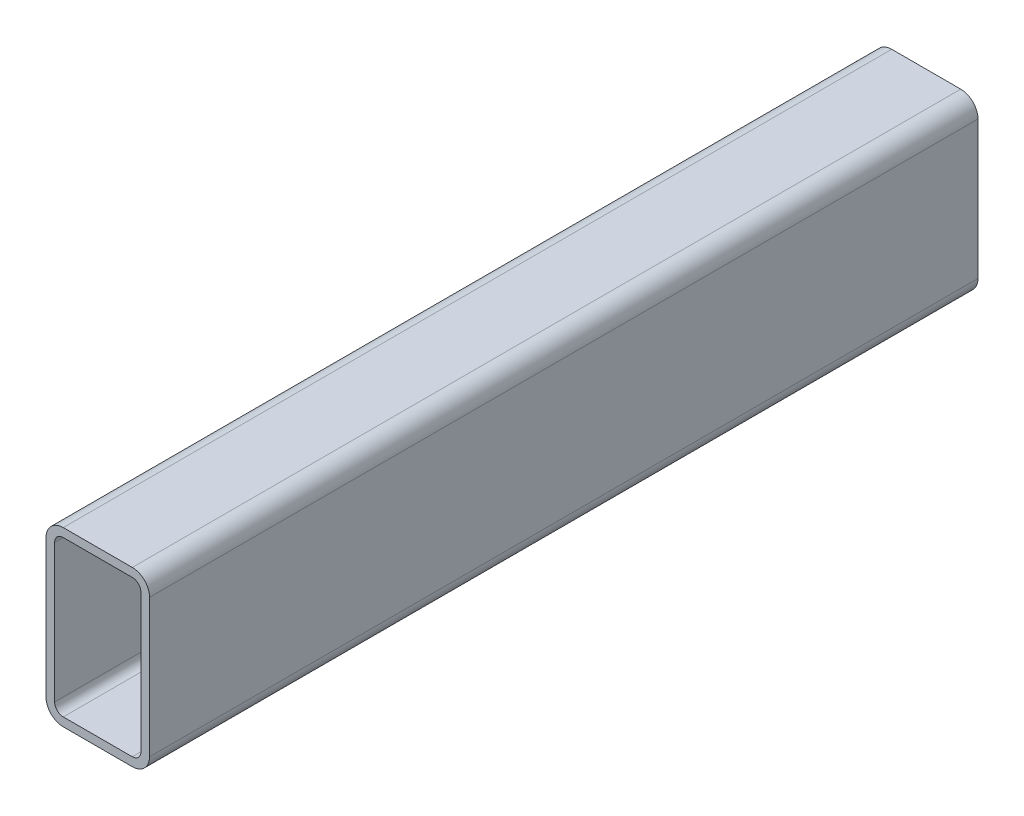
ISO-10303-21;
HEADER;
FILE_DESCRIPTION(('STEP AP214'),'2;1');
FILE_NAME('part.step','',(''),(''),'','','');
FILE_SCHEMA(('AUTOMOTIVE_DESIGN { 1 0 10303 214 1 1 1 1 }'));
ENDSEC;
DATA;
#1=APPLICATION_CONTEXT('core data for automotive mechanical design processes');
#2=APPLICATION_PROTOCOL_DEFINITION('international standard','automotive_design',2000,#1);
#3=PRODUCT_CONTEXT('',#1,'mechanical');
#4=PRODUCT('Part','Part','',(#3));
#5=PRODUCT_RELATED_PRODUCT_CATEGORY('part','',(#4));
#6=PRODUCT_DEFINITION_FORMATION('','',#4);
#7=PRODUCT_DEFINITION_CONTEXT('part definition',#1,'design');
#8=PRODUCT_DEFINITION('design','',#6,#7);
#9=PRODUCT_DEFINITION_SHAPE('','',#8);
#10=(LENGTH_UNIT() NAMED_UNIT(*) SI_UNIT(.MILLI.,.METRE.));
#11=(NAMED_UNIT(*) PLANE_ANGLE_UNIT() SI_UNIT($,.RADIAN.));
#12=(NAMED_UNIT(*) SI_UNIT($,.STERADIAN.) SOLID_ANGLE_UNIT());
#13=UNCERTAINTY_MEASURE_WITH_UNIT(LENGTH_MEASURE(1.E-05),#10,'distance_accuracy_value','');
#14=(GEOMETRIC_REPRESENTATION_CONTEXT(3) GLOBAL_UNCERTAINTY_ASSIGNED_CONTEXT((#13)) GLOBAL_UNIT_ASSIGNED_CONTEXT((#10,
#11,#12)) REPRESENTATION_CONTEXT('',''));
#15=CARTESIAN_POINT('',(0.,0.,0.));
#16=DIRECTION('',(0.,0.,1.));
#17=DIRECTION('',(1.,0.,0.));
#18=AXIS2_PLACEMENT_3D('',#15,#16,#17);
#19=CARTESIAN_POINT('',(6.35,57.15,304.8));
#20=DIRECTION('',(0.,0.,1.));
#21=DIRECTION('',(1.,0.,0.));
#22=AXIS2_PLACEMENT_3D('',#19,#20,#21);
#23=PLANE('',#22);
#24=CARTESIAN_POINT('',(6.35,57.15,304.8));
#25=DIRECTION('',(0.,0.,1.));
#26=DIRECTION('',(1.,0.,0.));
#27=AXIS2_PLACEMENT_3D('',#24,#25,#26);
#28=CIRCLE('',#27,6.35);
#29=CARTESIAN_POINT('',(6.35,63.5,304.8));
#30=VERTEX_POINT('',#29);
#31=CARTESIAN_POINT('',(0.,57.15,304.8));
#32=VERTEX_POINT('',#31);
#33=EDGE_CURVE('E211',#30,#32,#28,.T.);
#34=ORIENTED_EDGE('',*,*,#33,.T.);
#35=DIRECTION('',(0.,-1.,0.));
#36=VECTOR('',#35,1.);
#37=CARTESIAN_POINT('',(0.,6.35,304.8));
#38=LINE('',#37,#36);
#39=CARTESIAN_POINT('',(0.,6.35,304.8));
#40=VERTEX_POINT('',#39);
#41=EDGE_CURVE('E214',#32,#40,#38,.T.);
#42=ORIENTED_EDGE('',*,*,#41,.T.);
#43=CARTESIAN_POINT('',(6.35,6.35,304.8));
#44=DIRECTION('',(0.,0.,1.));
#45=DIRECTION('',(1.,0.,0.));
#46=AXIS2_PLACEMENT_3D('',#43,#44,#45);
#47=CIRCLE('',#46,6.35);
#48=CARTESIAN_POINT('',(6.35,0.,304.8));
#49=VERTEX_POINT('',#48);
#50=EDGE_CURVE('E217',#40,#49,#47,.T.);
#51=ORIENTED_EDGE('',*,*,#50,.T.);
#52=DIRECTION('',(1.,0.,0.));
#53=VECTOR('',#52,1.);
#54=CARTESIAN_POINT('',(31.75,0.,304.8));
#55=LINE('',#54,#53);
#56=CARTESIAN_POINT('',(31.75,0.,304.8));
#57=VERTEX_POINT('',#56);
#58=EDGE_CURVE('E219',#49,#57,#55,.T.);
#59=ORIENTED_EDGE('',*,*,#58,.T.);
#60=CARTESIAN_POINT('',(31.75,6.35,304.8));
#61=DIRECTION('',(0.,0.,1.));
#62=DIRECTION('',(1.,0.,0.));
#63=AXIS2_PLACEMENT_3D('',#60,#61,#62);
#64=CIRCLE('',#63,6.35);
#65=CARTESIAN_POINT('',(38.1,6.35,304.8));
#66=VERTEX_POINT('',#65);
#67=EDGE_CURVE('E221',#57,#66,#64,.T.);
#68=ORIENTED_EDGE('',*,*,#67,.T.);
#69=DIRECTION('',(0.,1.,0.));
#70=VECTOR('',#69,1.);
#71=CARTESIAN_POINT('',(38.1,57.15,304.8));
#72=LINE('',#71,#70);
#73=CARTESIAN_POINT('',(38.1,57.15,304.8));
#74=VERTEX_POINT('',#73);
#75=EDGE_CURVE('E223',#66,#74,#72,.T.);
#76=ORIENTED_EDGE('',*,*,#75,.T.);
#77=CARTESIAN_POINT('',(31.75,57.15,304.8));
#78=DIRECTION('',(0.,0.,1.));
#79=DIRECTION('',(1.,0.,0.));
#80=AXIS2_PLACEMENT_3D('',#77,#78,#79);
#81=CIRCLE('',#80,6.35);
#82=CARTESIAN_POINT('',(31.75,63.5,304.8));
#83=VERTEX_POINT('',#82);
#84=EDGE_CURVE('E225',#74,#83,#81,.T.);
#85=ORIENTED_EDGE('',*,*,#84,.T.);
#86=DIRECTION('',(-1.,0.,0.));
#87=VECTOR('',#86,1.);
#88=CARTESIAN_POINT('',(6.35,63.5,304.8));
#89=LINE('',#88,#87);
#90=EDGE_CURVE('E227',#83,#30,#89,.T.);
#91=ORIENTED_EDGE('',*,*,#90,.T.);
#92=EDGE_LOOP('',(#34,#42,#51,#59,#68,#76,#85,#91));
#93=FACE_BOUND('',#92,.T.);
#94=DIRECTION('',(0.,-1.,0.));
#95=VECTOR('',#94,1.);
#96=CARTESIAN_POINT('',(3.175,6.35,304.8));
#97=LINE('',#96,#95);
#98=CARTESIAN_POINT('',(3.175,57.15,304.8));
#99=VERTEX_POINT('',#98);
#100=CARTESIAN_POINT('',(3.175,6.35,304.8));
#101=VERTEX_POINT('',#100);
#102=EDGE_CURVE('E154',#99,#101,#97,.T.);
#103=ORIENTED_EDGE('',*,*,#102,.F.);
#104=CARTESIAN_POINT('',(6.35,57.15,304.8));
#105=DIRECTION('',(0.,0.,1.));
#106=DIRECTION('',(1.,0.,0.));
#107=AXIS2_PLACEMENT_3D('',#104,#105,#106);
#108=CIRCLE('',#107,3.17499999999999);
#109=CARTESIAN_POINT('',(6.35,60.325,304.8));
#110=VERTEX_POINT('',#109);
#111=EDGE_CURVE('E146',#110,#99,#108,.T.);
#112=ORIENTED_EDGE('',*,*,#111,.F.);
#113=DIRECTION('',(-1.,0.,0.));
#114=VECTOR('',#113,1.);
#115=CARTESIAN_POINT('',(6.35,60.325,304.8));
#116=LINE('',#115,#114);
#117=CARTESIAN_POINT('',(31.75,60.325,304.8));
#118=VERTEX_POINT('',#117);
#119=EDGE_CURVE('E179',#118,#110,#116,.T.);
#120=ORIENTED_EDGE('',*,*,#119,.F.);
#121=CARTESIAN_POINT('',(31.75,57.15,304.8));
#122=DIRECTION('',(0.,0.,1.));
#123=DIRECTION('',(1.,0.,0.));
#124=AXIS2_PLACEMENT_3D('',#121,#122,#123);
#125=CIRCLE('',#124,3.17499999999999);
#126=CARTESIAN_POINT('',(34.925,57.15,304.8));
#127=VERTEX_POINT('',#126);
#128=EDGE_CURVE('E177',#127,#118,#125,.T.);
#129=ORIENTED_EDGE('',*,*,#128,.F.);
#130=DIRECTION('',(0.,1.,0.));
#131=VECTOR('',#130,1.);
#132=CARTESIAN_POINT('',(34.925,57.15,304.8));
#133=LINE('',#132,#131);
#134=CARTESIAN_POINT('',(34.925,6.35,304.8));
#135=VERTEX_POINT('',#134);
#136=EDGE_CURVE('E175',#135,#127,#133,.T.);
#137=ORIENTED_EDGE('',*,*,#136,.F.);
#138=CARTESIAN_POINT('',(31.75,6.35,304.8));
#139=DIRECTION('',(0.,0.,1.));
#140=DIRECTION('',(1.,0.,0.));
#141=AXIS2_PLACEMENT_3D('',#138,#139,#140);
#142=CIRCLE('',#141,3.175);
#143=CARTESIAN_POINT('',(31.75,3.175,304.8));
#144=VERTEX_POINT('',#143);
#145=EDGE_CURVE('E173',#144,#135,#142,.T.);
#146=ORIENTED_EDGE('',*,*,#145,.F.);
#147=DIRECTION('',(1.,0.,0.));
#148=VECTOR('',#147,1.);
#149=CARTESIAN_POINT('',(31.75,3.175,304.8));
#150=LINE('',#149,#148);
#151=CARTESIAN_POINT('',(6.35,3.175,304.8));
#152=VERTEX_POINT('',#151);
#153=EDGE_CURVE('E169',#152,#144,#150,.T.);
#154=ORIENTED_EDGE('',*,*,#153,.F.);
#155=CARTESIAN_POINT('',(6.35,6.35,304.8));
#156=DIRECTION('',(0.,0.,1.));
#157=DIRECTION('',(1.,0.,0.));
#158=AXIS2_PLACEMENT_3D('',#155,#156,#157);
#159=CIRCLE('',#158,3.175);
#160=EDGE_CURVE('E167',#101,#152,#159,.T.);
#161=ORIENTED_EDGE('',*,*,#160,.F.);
#162=EDGE_LOOP('',(#103,#112,#120,#129,#137,#146,#154,#161));
#163=FACE_BOUND('',#162,.T.);
#164=ADVANCED_FACE('F33',(#93,#163),#23,.T.);
#165=CARTESIAN_POINT('',(6.35,57.15,0.));
#166=DIRECTION('',(0.,0.,1.));
#167=DIRECTION('',(1.,0.,0.));
#168=AXIS2_PLACEMENT_3D('',#165,#166,#167);
#169=PLANE('',#168);
#170=CARTESIAN_POINT('',(6.35,57.15,0.));
#171=DIRECTION('',(0.,0.,1.));
#172=DIRECTION('',(1.,0.,0.));
#173=AXIS2_PLACEMENT_3D('',#170,#171,#172);
#174=CIRCLE('',#173,6.35);
#175=CARTESIAN_POINT('',(6.35,63.5,0.));
#176=VERTEX_POINT('',#175);
#177=CARTESIAN_POINT('',(0.,57.15,0.));
#178=VERTEX_POINT('',#177);
#179=EDGE_CURVE('E162',#176,#178,#174,.T.);
#180=ORIENTED_EDGE('',*,*,#179,.F.);
#181=DIRECTION('',(-1.,0.,0.));
#182=VECTOR('',#181,1.);
#183=CARTESIAN_POINT('',(6.35,63.5,0.));
#184=LINE('',#183,#182);
#185=CARTESIAN_POINT('',(31.75,63.5,0.));
#186=VERTEX_POINT('',#185);
#187=EDGE_CURVE('E215',#186,#176,#184,.T.);
#188=ORIENTED_EDGE('',*,*,#187,.F.);
#189=CARTESIAN_POINT('',(31.75,57.15,0.));
#190=DIRECTION('',(0.,0.,1.));
#191=DIRECTION('',(1.,0.,0.));
#192=AXIS2_PLACEMENT_3D('',#189,#190,#191);
#193=CIRCLE('',#192,6.35);
#194=CARTESIAN_POINT('',(38.1,57.15,0.));
#195=VERTEX_POINT('',#194);
#196=EDGE_CURVE('E242',#195,#186,#193,.T.);
#197=ORIENTED_EDGE('',*,*,#196,.F.);
#198=DIRECTION('',(0.,1.,0.));
#199=VECTOR('',#198,1.);
#200=CARTESIAN_POINT('',(38.1,57.15,0.));
#201=LINE('',#200,#199);
#202=CARTESIAN_POINT('',(38.1,6.35,0.));
#203=VERTEX_POINT('',#202);
#204=EDGE_CURVE('E240',#203,#195,#201,.T.);
#205=ORIENTED_EDGE('',*,*,#204,.F.);
#206=CARTESIAN_POINT('',(31.75,6.35,0.));
#207=DIRECTION('',(0.,0.,1.));
#208=DIRECTION('',(1.,0.,0.));
#209=AXIS2_PLACEMENT_3D('',#206,#207,#208);
#210=CIRCLE('',#209,6.35);
#211=CARTESIAN_POINT('',(31.75,0.,0.));
#212=VERTEX_POINT('',#211);
#213=EDGE_CURVE('E238',#212,#203,#210,.T.);
#214=ORIENTED_EDGE('',*,*,#213,.F.);
#215=DIRECTION('',(1.,0.,0.));
#216=VECTOR('',#215,1.);
#217=CARTESIAN_POINT('',(31.75,0.,0.));
#218=LINE('',#217,#216);
#219=CARTESIAN_POINT('',(6.35,0.,0.));
#220=VERTEX_POINT('',#219);
#221=EDGE_CURVE('E236',#220,#212,#218,.T.);
#222=ORIENTED_EDGE('',*,*,#221,.F.);
#223=CARTESIAN_POINT('',(6.35,6.35,0.));
#224=DIRECTION('',(0.,0.,1.));
#225=DIRECTION('',(1.,0.,0.));
#226=AXIS2_PLACEMENT_3D('',#223,#224,#225);
#227=CIRCLE('',#226,6.35);
#228=CARTESIAN_POINT('',(0.,6.35,0.));
#229=VERTEX_POINT('',#228);
#230=EDGE_CURVE('E234',#229,#220,#227,.T.);
#231=ORIENTED_EDGE('',*,*,#230,.F.);
#232=DIRECTION('',(0.,-1.,0.));
#233=VECTOR('',#232,1.);
#234=CARTESIAN_POINT('',(0.,6.35,0.));
#235=LINE('',#234,#233);
#236=EDGE_CURVE('E232',#178,#229,#235,.T.);
#237=ORIENTED_EDGE('',*,*,#236,.F.);
#238=EDGE_LOOP('',(#180,#188,#197,#205,#214,#222,#231,#237));
#239=FACE_BOUND('',#238,.T.);
#240=CARTESIAN_POINT('',(6.35,57.15,0.));
#241=DIRECTION('',(0.,0.,1.));
#242=DIRECTION('',(1.,0.,0.));
#243=AXIS2_PLACEMENT_3D('',#240,#241,#242);
#244=CIRCLE('',#243,3.17499999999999);
#245=CARTESIAN_POINT('',(6.35,60.325,0.));
#246=VERTEX_POINT('',#245);
#247=CARTESIAN_POINT('',(3.175,57.15,0.));
#248=VERTEX_POINT('',#247);
#249=EDGE_CURVE('E56',#246,#248,#244,.T.);
#250=ORIENTED_EDGE('',*,*,#249,.T.);
#251=DIRECTION('',(0.,-1.,0.));
#252=VECTOR('',#251,1.);
#253=CARTESIAN_POINT('',(3.175,6.35,0.));
#254=LINE('',#253,#252);
#255=CARTESIAN_POINT('',(3.175,6.35,0.));
#256=VERTEX_POINT('',#255);
#257=EDGE_CURVE('E161',#248,#256,#254,.T.);
#258=ORIENTED_EDGE('',*,*,#257,.T.);
#259=CARTESIAN_POINT('',(6.35,6.35,0.));
#260=DIRECTION('',(0.,0.,1.));
#261=DIRECTION('',(1.,0.,0.));
#262=AXIS2_PLACEMENT_3D('',#259,#260,#261);
#263=CIRCLE('',#262,3.175);
#264=CARTESIAN_POINT('',(6.35,3.175,0.));
#265=VERTEX_POINT('',#264);
#266=EDGE_CURVE('E183',#256,#265,#263,.T.);
#267=ORIENTED_EDGE('',*,*,#266,.T.);
#268=DIRECTION('',(1.,0.,0.));
#269=VECTOR('',#268,1.);
#270=CARTESIAN_POINT('',(31.75,3.175,0.));
#271=LINE('',#270,#269);
#272=CARTESIAN_POINT('',(31.75,3.175,0.));
#273=VERTEX_POINT('',#272);
#274=EDGE_CURVE('E186',#265,#273,#271,.T.);
#275=ORIENTED_EDGE('',*,*,#274,.T.);
#276=CARTESIAN_POINT('',(31.75,6.35,0.));
#277=DIRECTION('',(0.,0.,1.));
#278=DIRECTION('',(1.,0.,0.));
#279=AXIS2_PLACEMENT_3D('',#276,#277,#278);
#280=CIRCLE('',#279,3.175);
#281=CARTESIAN_POINT('',(34.925,6.35,0.));
#282=VERTEX_POINT('',#281);
#283=EDGE_CURVE('E189',#273,#282,#280,.T.);
#284=ORIENTED_EDGE('',*,*,#283,.T.);
#285=DIRECTION('',(0.,1.,0.));
#286=VECTOR('',#285,1.);
#287=CARTESIAN_POINT('',(34.925,57.15,0.));
#288=LINE('',#287,#286);
#289=CARTESIAN_POINT('',(34.925,57.15,0.));
#290=VERTEX_POINT('',#289);
#291=EDGE_CURVE('E192',#282,#290,#288,.T.);
#292=ORIENTED_EDGE('',*,*,#291,.T.);
#293=CARTESIAN_POINT('',(31.75,57.15,0.));
#294=DIRECTION('',(0.,0.,1.));
#295=DIRECTION('',(1.,0.,0.));
#296=AXIS2_PLACEMENT_3D('',#293,#294,#295);
#297=CIRCLE('',#296,3.17499999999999);
#298=CARTESIAN_POINT('',(31.75,60.325,0.));
#299=VERTEX_POINT('',#298);
#300=EDGE_CURVE('E195',#290,#299,#297,.T.);
#301=ORIENTED_EDGE('',*,*,#300,.T.);
#302=DIRECTION('',(-1.,0.,0.));
#303=VECTOR('',#302,1.);
#304=CARTESIAN_POINT('',(6.35,60.325,0.));
#305=LINE('',#304,#303);
#306=EDGE_CURVE('E155',#299,#246,#305,.T.);
#307=ORIENTED_EDGE('',*,*,#306,.T.);
#308=EDGE_LOOP('',(#250,#258,#267,#275,#284,#292,#301,#307));
#309=FACE_BOUND('',#308,.T.);
#310=ADVANCED_FACE('F272',(#239,#309),#169,.F.);
#311=CARTESIAN_POINT('',(6.35,57.15,304.8));
#312=DIRECTION('',(0.,0.,-1.));
#313=DIRECTION('',(-1.,0.,0.));
#314=AXIS2_PLACEMENT_3D('',#311,#312,#313);
#315=CYLINDRICAL_SURFACE('',#314,6.35);
#316=ORIENTED_EDGE('',*,*,#179,.T.);
#317=DIRECTION('',(0.,0.,-1.));
#318=VECTOR('',#317,1.);
#319=CARTESIAN_POINT('',(0.,57.15,304.8));
#320=LINE('',#319,#318);
#321=EDGE_CURVE('E11',#32,#178,#320,.T.);
#322=ORIENTED_EDGE('',*,*,#321,.F.);
#323=ORIENTED_EDGE('',*,*,#33,.F.);
#324=DIRECTION('',(0.,0.,-1.));
#325=VECTOR('',#324,1.);
#326=CARTESIAN_POINT('',(6.35,63.5,304.8));
#327=LINE('',#326,#325);
#328=EDGE_CURVE('E229',#30,#176,#327,.T.);
#329=ORIENTED_EDGE('',*,*,#328,.T.);
#330=EDGE_LOOP('',(#316,#322,#323,#329));
#331=FACE_BOUND('',#330,.T.);
#332=ADVANCED_FACE('F35',(#331),#315,.T.);
#333=CARTESIAN_POINT('',(0.,6.35,304.8));
#334=DIRECTION('',(1.,0.,0.));
#335=DIRECTION('',(0.,0.,-1.));
#336=AXIS2_PLACEMENT_3D('',#333,#334,#335);
#337=PLANE('',#336);
#338=ORIENTED_EDGE('',*,*,#236,.T.);
#339=DIRECTION('',(0.,0.,-1.));
#340=VECTOR('',#339,1.);
#341=CARTESIAN_POINT('',(0.,6.35,304.8));
#342=LINE('',#341,#340);
#343=EDGE_CURVE('E41',#40,#229,#342,.T.);
#344=ORIENTED_EDGE('',*,*,#343,.F.);
#345=ORIENTED_EDGE('',*,*,#41,.F.);
#346=ORIENTED_EDGE('',*,*,#321,.T.);
#347=EDGE_LOOP('',(#338,#344,#345,#346));
#348=FACE_BOUND('',#347,.T.);
#349=ADVANCED_FACE('F289',(#348),#337,.F.);
#350=CARTESIAN_POINT('',(6.35,6.35,304.8));
#351=DIRECTION('',(0.,0.,-1.));
#352=DIRECTION('',(-1.,0.,0.));
#353=AXIS2_PLACEMENT_3D('',#350,#351,#352);
#354=CYLINDRICAL_SURFACE('',#353,6.35);
#355=ORIENTED_EDGE('',*,*,#230,.T.);
#356=DIRECTION('',(0.,0.,-1.));
#357=VECTOR('',#356,1.);
#358=CARTESIAN_POINT('',(6.35,0.,304.8));
#359=LINE('',#358,#357);
#360=EDGE_CURVE('E259',#49,#220,#359,.T.);
#361=ORIENTED_EDGE('',*,*,#360,.F.);
#362=ORIENTED_EDGE('',*,*,#50,.F.);
#363=ORIENTED_EDGE('',*,*,#343,.T.);
#364=EDGE_LOOP('',(#355,#361,#362,#363));
#365=FACE_BOUND('',#364,.T.);
#366=ADVANCED_FACE('F266',(#365),#354,.T.);
#367=CARTESIAN_POINT('',(31.75,0.,304.8));
#368=DIRECTION('',(0.,1.,0.));
#369=DIRECTION('',(0.,0.,1.));
#370=AXIS2_PLACEMENT_3D('',#367,#368,#369);
#371=PLANE('',#370);
#372=ORIENTED_EDGE('',*,*,#221,.T.);
#373=DIRECTION('',(0.,0.,-1.));
#374=VECTOR('',#373,1.);
#375=CARTESIAN_POINT('',(31.75,0.,304.8));
#376=LINE('',#375,#374);
#377=EDGE_CURVE('E256',#57,#212,#376,.T.);
#378=ORIENTED_EDGE('',*,*,#377,.F.);
#379=ORIENTED_EDGE('',*,*,#58,.F.);
#380=ORIENTED_EDGE('',*,*,#360,.T.);
#381=EDGE_LOOP('',(#372,#378,#379,#380));
#382=FACE_BOUND('',#381,.T.);
#383=ADVANCED_FACE('F278',(#382),#371,.F.);
#384=CARTESIAN_POINT('',(31.75,6.35,304.8));
#385=DIRECTION('',(0.,0.,-1.));
#386=DIRECTION('',(-1.,0.,0.));
#387=AXIS2_PLACEMENT_3D('',#384,#385,#386);
#388=CYLINDRICAL_SURFACE('',#387,6.35);
#389=ORIENTED_EDGE('',*,*,#213,.T.);
#390=DIRECTION('',(0.,0.,-1.));
#391=VECTOR('',#390,1.);
#392=CARTESIAN_POINT('',(38.1,6.35,304.8));
#393=LINE('',#392,#391);
#394=EDGE_CURVE('E253',#66,#203,#393,.T.);
#395=ORIENTED_EDGE('',*,*,#394,.F.);
#396=ORIENTED_EDGE('',*,*,#67,.F.);
#397=ORIENTED_EDGE('',*,*,#377,.T.);
#398=EDGE_LOOP('',(#389,#395,#396,#397));
#399=FACE_BOUND('',#398,.T.);
#400=ADVANCED_FACE('F282',(#399),#388,.T.);
#401=CARTESIAN_POINT('',(38.1,57.15,304.8));
#402=DIRECTION('',(-1.,0.,0.));
#403=DIRECTION('',(0.,0.,1.));
#404=AXIS2_PLACEMENT_3D('',#401,#402,#403);
#405=PLANE('',#404);
#406=ORIENTED_EDGE('',*,*,#204,.T.);
#407=DIRECTION('',(0.,0.,-1.));
#408=VECTOR('',#407,1.);
#409=CARTESIAN_POINT('',(38.1,57.15,304.8));
#410=LINE('',#409,#408);
#411=EDGE_CURVE('E250',#74,#195,#410,.T.);
#412=ORIENTED_EDGE('',*,*,#411,.F.);
#413=ORIENTED_EDGE('',*,*,#75,.F.);
#414=ORIENTED_EDGE('',*,*,#394,.T.);
#415=EDGE_LOOP('',(#406,#412,#413,#414));
#416=FACE_BOUND('',#415,.T.);
#417=ADVANCED_FACE('F302',(#416),#405,.F.);
#418=CARTESIAN_POINT('',(31.75,57.15,304.8));
#419=DIRECTION('',(0.,0.,-1.));
#420=DIRECTION('',(-1.,0.,0.));
#421=AXIS2_PLACEMENT_3D('',#418,#419,#420);
#422=CYLINDRICAL_SURFACE('',#421,6.35);
#423=ORIENTED_EDGE('',*,*,#196,.T.);
#424=DIRECTION('',(0.,0.,-1.));
#425=VECTOR('',#424,1.);
#426=CARTESIAN_POINT('',(31.75,63.5,304.8));
#427=LINE('',#426,#425);
#428=EDGE_CURVE('E247',#83,#186,#427,.T.);
#429=ORIENTED_EDGE('',*,*,#428,.F.);
#430=ORIENTED_EDGE('',*,*,#84,.F.);
#431=ORIENTED_EDGE('',*,*,#411,.T.);
#432=EDGE_LOOP('',(#423,#429,#430,#431));
#433=FACE_BOUND('',#432,.T.);
#434=ADVANCED_FACE('F300',(#433),#422,.T.);
#435=CARTESIAN_POINT('',(6.35,63.5,304.8));
#436=DIRECTION('',(0.,-1.,0.));
#437=DIRECTION('',(0.,0.,-1.));
#438=AXIS2_PLACEMENT_3D('',#435,#436,#437);
#439=PLANE('',#438);
#440=ORIENTED_EDGE('',*,*,#187,.T.);
#441=ORIENTED_EDGE('',*,*,#328,.F.);
#442=ORIENTED_EDGE('',*,*,#90,.F.);
#443=ORIENTED_EDGE('',*,*,#428,.T.);
#444=EDGE_LOOP('',(#440,#441,#442,#443));
#445=FACE_BOUND('',#444,.T.);
#446=ADVANCED_FACE('F295',(#445),#439,.F.);
#447=CARTESIAN_POINT('',(6.35,57.15,304.8));
#448=DIRECTION('',(0.,0.,-1.));
#449=DIRECTION('',(-1.,0.,0.));
#450=AXIS2_PLACEMENT_3D('',#447,#448,#449);
#451=CYLINDRICAL_SURFACE('',#450,3.17499999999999);
#452=ORIENTED_EDGE('',*,*,#249,.F.);
#453=DIRECTION('',(0.,0.,-1.));
#454=VECTOR('',#453,1.);
#455=CARTESIAN_POINT('',(6.35,60.325,304.8));
#456=LINE('',#455,#454);
#457=EDGE_CURVE('E150',#110,#246,#456,.T.);
#458=ORIENTED_EDGE('',*,*,#457,.F.);
#459=ORIENTED_EDGE('',*,*,#111,.T.);
#460=DIRECTION('',(0.,0.,-1.));
#461=VECTOR('',#460,1.);
#462=CARTESIAN_POINT('',(3.175,57.15,304.8));
#463=LINE('',#462,#461);
#464=EDGE_CURVE('E149',#99,#248,#463,.T.);
#465=ORIENTED_EDGE('',*,*,#464,.T.);
#466=EDGE_LOOP('',(#452,#458,#459,#465));
#467=FACE_BOUND('',#466,.T.);
#468=ADVANCED_FACE('F148',(#467),#451,.F.);
#469=CARTESIAN_POINT('',(3.175,6.35,304.8));
#470=DIRECTION('',(1.,0.,0.));
#471=DIRECTION('',(0.,0.,-1.));
#472=AXIS2_PLACEMENT_3D('',#469,#470,#471);
#473=PLANE('',#472);
#474=ORIENTED_EDGE('',*,*,#257,.F.);
#475=ORIENTED_EDGE('',*,*,#464,.F.);
#476=ORIENTED_EDGE('',*,*,#102,.T.);
#477=DIRECTION('',(0.,0.,-1.));
#478=VECTOR('',#477,1.);
#479=CARTESIAN_POINT('',(3.175,6.35,304.8));
#480=LINE('',#479,#478);
#481=EDGE_CURVE('E163',#101,#256,#480,.T.);
#482=ORIENTED_EDGE('',*,*,#481,.T.);
#483=EDGE_LOOP('',(#474,#475,#476,#482));
#484=FACE_BOUND('',#483,.T.);
#485=ADVANCED_FACE('F158',(#484),#473,.T.);
#486=CARTESIAN_POINT('',(6.35,6.35,304.8));
#487=DIRECTION('',(0.,0.,-1.));
#488=DIRECTION('',(-1.,0.,0.));
#489=AXIS2_PLACEMENT_3D('',#486,#487,#488);
#490=CYLINDRICAL_SURFACE('',#489,3.175);
#491=ORIENTED_EDGE('',*,*,#266,.F.);
#492=ORIENTED_EDGE('',*,*,#481,.F.);
#493=ORIENTED_EDGE('',*,*,#160,.T.);
#494=DIRECTION('',(0.,0.,-1.));
#495=VECTOR('',#494,1.);
#496=CARTESIAN_POINT('',(6.35,3.175,304.8));
#497=LINE('',#496,#495);
#498=EDGE_CURVE('E208',#152,#265,#497,.T.);
#499=ORIENTED_EDGE('',*,*,#498,.T.);
#500=EDGE_LOOP('',(#491,#492,#493,#499));
#501=FACE_BOUND('',#500,.T.);
#502=ADVANCED_FACE('F327',(#501),#490,.F.);
#503=CARTESIAN_POINT('',(31.75,3.175,304.8));
#504=DIRECTION('',(0.,1.,0.));
#505=DIRECTION('',(0.,0.,1.));
#506=AXIS2_PLACEMENT_3D('',#503,#504,#505);
#507=PLANE('',#506);
#508=ORIENTED_EDGE('',*,*,#274,.F.);
#509=ORIENTED_EDGE('',*,*,#498,.F.);
#510=ORIENTED_EDGE('',*,*,#153,.T.);
#511=DIRECTION('',(0.,0.,-1.));
#512=VECTOR('',#511,1.);
#513=CARTESIAN_POINT('',(31.75,3.175,304.8));
#514=LINE('',#513,#512);
#515=EDGE_CURVE('E206',#144,#273,#514,.T.);
#516=ORIENTED_EDGE('',*,*,#515,.T.);
#517=EDGE_LOOP('',(#508,#509,#510,#516));
#518=FACE_BOUND('',#517,.T.);
#519=ADVANCED_FACE('F331',(#518),#507,.T.);
#520=CARTESIAN_POINT('',(31.75,6.35,304.8));
#521=DIRECTION('',(0.,0.,-1.));
#522=DIRECTION('',(-1.,0.,0.));
#523=AXIS2_PLACEMENT_3D('',#520,#521,#522);
#524=CYLINDRICAL_SURFACE('',#523,3.175);
#525=ORIENTED_EDGE('',*,*,#283,.F.);
#526=ORIENTED_EDGE('',*,*,#515,.F.);
#527=ORIENTED_EDGE('',*,*,#145,.T.);
#528=DIRECTION('',(0.,0.,-1.));
#529=VECTOR('',#528,1.);
#530=CARTESIAN_POINT('',(34.925,6.35,304.8));
#531=LINE('',#530,#529);
#532=EDGE_CURVE('E204',#135,#282,#531,.T.);
#533=ORIENTED_EDGE('',*,*,#532,.T.);
#534=EDGE_LOOP('',(#525,#526,#527,#533));
#535=FACE_BOUND('',#534,.T.);
#536=ADVANCED_FACE('F337',(#535),#524,.F.);
#537=CARTESIAN_POINT('',(34.925,57.15,304.8));
#538=DIRECTION('',(-1.,0.,0.));
#539=DIRECTION('',(0.,0.,1.));
#540=AXIS2_PLACEMENT_3D('',#537,#538,#539);
#541=PLANE('',#540);
#542=ORIENTED_EDGE('',*,*,#291,.F.);
#543=ORIENTED_EDGE('',*,*,#532,.F.);
#544=ORIENTED_EDGE('',*,*,#136,.T.);
#545=DIRECTION('',(0.,0.,-1.));
#546=VECTOR('',#545,1.);
#547=CARTESIAN_POINT('',(34.925,57.15,304.8));
#548=LINE('',#547,#546);
#549=EDGE_CURVE('E202',#127,#290,#548,.T.);
#550=ORIENTED_EDGE('',*,*,#549,.T.);
#551=EDGE_LOOP('',(#542,#543,#544,#550));
#552=FACE_BOUND('',#551,.T.);
#553=ADVANCED_FACE('F341',(#552),#541,.T.);
#554=CARTESIAN_POINT('',(31.75,57.15,304.8));
#555=DIRECTION('',(0.,0.,-1.));
#556=DIRECTION('',(-1.,0.,0.));
#557=AXIS2_PLACEMENT_3D('',#554,#555,#556);
#558=CYLINDRICAL_SURFACE('',#557,3.17499999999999);
#559=ORIENTED_EDGE('',*,*,#300,.F.);
#560=ORIENTED_EDGE('',*,*,#549,.F.);
#561=ORIENTED_EDGE('',*,*,#128,.T.);
#562=DIRECTION('',(0.,0.,-1.));
#563=VECTOR('',#562,1.);
#564=CARTESIAN_POINT('',(31.75,60.325,304.8));
#565=LINE('',#564,#563);
#566=EDGE_CURVE('E48',#118,#299,#565,.T.);
#567=ORIENTED_EDGE('',*,*,#566,.T.);
#568=EDGE_LOOP('',(#559,#560,#561,#567));
#569=FACE_BOUND('',#568,.T.);
#570=ADVANCED_FACE('F345',(#569),#558,.F.);
#571=CARTESIAN_POINT('',(6.35,60.325,304.8));
#572=DIRECTION('',(0.,-1.,0.));
#573=DIRECTION('',(0.,0.,-1.));
#574=AXIS2_PLACEMENT_3D('',#571,#572,#573);
#575=PLANE('',#574);
#576=ORIENTED_EDGE('',*,*,#306,.F.);
#577=ORIENTED_EDGE('',*,*,#566,.F.);
#578=ORIENTED_EDGE('',*,*,#119,.T.);
#579=ORIENTED_EDGE('',*,*,#457,.T.);
#580=EDGE_LOOP('',(#576,#577,#578,#579));
#581=FACE_BOUND('',#580,.T.);
#582=ADVANCED_FACE('F349',(#581),#575,.T.);
#583=CLOSED_SHELL('',(#164,#310,#332,#349,#366,#383,#400,#417,#434,#446,#468,#485,#502,#519,
#536,#553,#570,#582));
#584=MANIFOLD_SOLID_BREP('B2',#583);
#585=ADVANCED_BREP_SHAPE_REPRESENTATION('',(#18,#584),#14);
#586=SHAPE_DEFINITION_REPRESENTATION(#9,#585);
ENDSEC;
END-ISO-10303-21;
